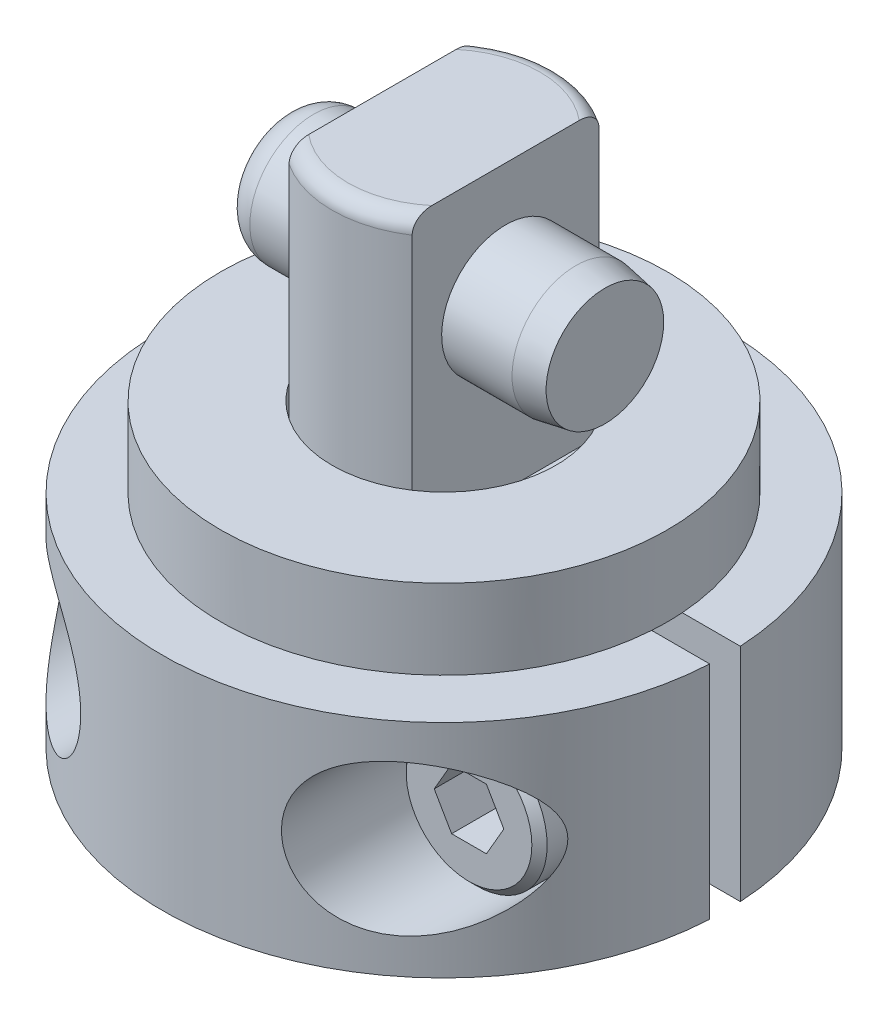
from build123d import *

# Parameters (mm, degrees)
FILLET1_R                  = 0.7874
CUT_EXTRUDE1_DEPTH         = 23.644751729
CUT_EXTRUDE1_DEPTH_BACK    = 23.644751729
SKETCH2_W                  = 2.5019
SKETCH2_H                  = 14.0716
CUT_EXTRUDE2_START         = 2.54
SKETCH3_R                  = 2.9972
SKETCH3_R_2                = 2.413
CUT_EXTRUDE2_DEPTH         = 2.54
CHAMFER1_SIZE              = 0.762
SKETCH4_R                  = 3.17754
EXTRUDE1_DEPTH             = 8.001
CHAMFER2_SIZE              = 0.254
CHAMFER2_SIZE2             = 1.440505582
FILLET2_R                  = 1.524
EXTRUDE2_DEPTH             = 5.4991
EXTRUDE2_DEPTH_BACK        = 5.4991
CUT_EXTRUDE3_START         = 2.7432
SKETCH6_R                  = 3.7465
CUT_EXTRUDE3_DEPTH         = 27.650186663
SKETCH7_R                  = 3.5052
EXTRUDE3_DEPTH             = 3.9878
CHAMFER3_SIZE              = 0.381
CUT_EXTRUDE4_DEPTH         = 2.9972
EXTRUDE4_REACH             = 31.018
SKETCH10_R                 = 1.9939
EXTRUDE4_DIRECTION_2_REACH = 31.018
SKETCH11_R                 = 11.1125
SKETCH11_R_2               = 5.5626
EXTRUDE5_DEPTH             = 3.9624


with BuildPart() as part:
    # Sketch1 → Revolve1 (revolve)
    with BuildSketch(Plane(origin=(0, 0, 0), x_dir=(0, 0, -1), z_dir=(1, 0, 0))):
        Polygon((0, 21.2344), (5.5626, 21.2344), (5.5626, 0.6096), (2.9972, 0.6096), (2.9972, -5.7404), (0, -5.7404), align=None)
    revolve(axis=Axis((0, -15.35938, 0), (0, 1, 0)))

    # Fillet1
    fillet1_edges = [part.edges().sort_by_distance(p)[0] for p in [
        (0, 21.2344, 5.5626),
    ]]
    fillet(fillet1_edges, radius=FILLET1_R)

    # Sketch2 → Cut-Extrude1 (cut, two sides: drawn at the far end of the back side and taken through both)
    with BuildSketch(Plane.XY.offset(-CUT_EXTRUDE1_DEPTH_BACK)):
        with Locations((4.31165, 14.1986)):
            Rectangle(SKETCH2_W, SKETCH2_H)
        with Locations((-4.31165, 14.1986)):
            Rectangle(SKETCH2_W, SKETCH2_H)
    extrude(amount=CUT_EXTRUDE1_DEPTH + CUT_EXTRUDE1_DEPTH_BACK, mode=Mode.SUBTRACT)

    # Sketch3 → Cut-Extrude2 (cut)
    with BuildSketch(Plane.XZ.offset(-0.6096).offset(CUT_EXTRUDE2_START)):
        with Locations(Location((0, 0, 0), (0, 0, 270))):
            Circle(SKETCH3_R)
        with Locations(Location((0, 0, 0), (0, 0, 270))):
            Circle(SKETCH3_R_2, mode=Mode.SUBTRACT)
    extrude(amount=-CUT_EXTRUDE2_DEPTH, mode=Mode.SUBTRACT)

    # Chamfer1
    chamfer1_edges = [part.edges().sort_by_distance(p)[0] for p in [
        (0, -5.7404, 2.9972),
    ]]
    chamfer(chamfer1_edges, length=CHAMFER1_SIZE)

    # Sketch4 → Extrude1 (add, symmetric)
    with BuildSketch(Plane(origin=(0, 0, 0), x_dir=(0, 0, -1), z_dir=(1, 0, 0))):
        with Locations(Location((0, 15.3924, 0), (0, 0, 90))):
            Circle(SKETCH4_R)
    extrude(amount=EXTRUDE1_DEPTH, both=True)

    # Chamfer2
    chamfer2_edges = [part.edges().sort_by_distance(p)[0] for p in [
        (8.001, 12.21486, 0),
    ]]
    chamfer2_side = [part.faces().sort_by_distance(p)[0] for p in [
        (8.001, 15.3924, 0),
    ]]
    chamfer(chamfer2_edges, length=CHAMFER2_SIZE, length2=CHAMFER2_SIZE2, reference=chamfer2_side[0])

    # Fillet2
    fillet2_edges = [part.edges().sort_by_distance(p)[0] for p in [
        (-8.001, 12.21486, 0),
    ]]
    fillet(fillet2_edges, radius=FILLET2_R)

    # Sketch5 → Extrude2 (add, two sides: drawn at the far end of the back side and taken through both)
    with BuildSketch(Plane(origin=(0, 0, 0), x_dir=(1, 0, 0), z_dir=(0, 1, 0)).offset(-EXTRUDE2_DEPTH_BACK)):
        with BuildLine():
            Line((5.510161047, 0.762), (13.974640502, 0.762))
            ThreePointArc((13.974640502, 0.762), (0, 13.9954), (-13.974640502, 0.762))
            Line((-13.974640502, 0.762), (-5.510161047, 0.762))
            ThreePointArc((-5.510161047, 0.762), (0, 5.5626), (5.510161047, 0.762))
        make_face()
        with BuildLine():
            Line((5.510161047, -0.762), (13.974640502, -0.762))
            ThreePointArc((13.974640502, -0.762), (0, -13.9954), (-13.974640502, -0.762))
            Line((-13.974640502, -0.762), (-5.510161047, -0.762))
            ThreePointArc((-5.510161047, -0.762), (0, -5.5626), (5.510161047, -0.762))
        make_face()
    extrude(amount=EXTRUDE2_DEPTH + EXTRUDE2_DEPTH_BACK)

    # Sketch6 → Cut-Extrude3 (cut, through all)
    with BuildSketch(Plane.XY.offset(0.762).offset(CUT_EXTRUDE3_START)):
        with Locations(Location((8.7376, 0, 0), (0, 0, 180))):
            Circle(SKETCH6_R)
        with Locations(Location((-8.7376, 0, 0), (0, 0, 180))):
            Circle(SKETCH6_R)
    extrude(amount=CUT_EXTRUDE3_DEPTH, mode=Mode.SUBTRACT)

    # Sketch7 → Extrude3 (add)
    with BuildSketch(Plane.XY.offset(3.5052)):
        with Locations((8.7376, 0)):
            Circle(SKETCH7_R)
        with Locations((-8.7376, 0)):
            Circle(SKETCH7_R)
    extrude(amount=EXTRUDE3_DEPTH)

    # Chamfer3
    chamfer3_edges = [part.edges().sort_by_distance(p)[0] for p in [
        (5.2324, 0, 7.493),
        (-12.2428, 0, 7.493),
    ]]
    chamfer(chamfer3_edges, length=CHAMFER3_SIZE)

    # Sketch8 → Cut-Extrude4 (cut)
    with BuildSketch(Plane.XY.offset(7.493)):
        Polygon((9.602817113, 1.4986), (10.468034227, 0), (9.602817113, -1.4986), (7.872382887, -1.4986), (7.007165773, 0), (7.872382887, 1.4986), align=None)
        Polygon((-10.468034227, 0), (-9.602817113, -1.4986), (-7.872382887, -1.4986), (-7.007165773, 0), (-7.872382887, 1.4986), (-9.602817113, 1.4986), align=None)
    extrude(amount=-CUT_EXTRUDE4_DEPTH, mode=Mode.SUBTRACT)

    # Sketch10 → Extrude4 (add, up to next)
    with BuildSketch(Plane.XY, mode=Mode.PRIVATE) as extrude4_sk1:
        with Locations((8.7376, 0)):
            Circle(SKETCH10_R)
    extrude4_tool1 = extrude(extrude4_sk1.sketch, amount=EXTRUDE4_REACH, mode=Mode.PRIVATE) - part.part
    # Sketch10 → Extrude4 (add, up to next)
    with BuildSketch(Plane.XY, mode=Mode.PRIVATE) as extrude4_sk2:
        with Locations((-8.7376, 0)):
            Circle(SKETCH10_R)
    extrude4_tool2 = extrude(extrude4_sk2.sketch, amount=EXTRUDE4_REACH, mode=Mode.PRIVATE) - part.part
    add(extrude4_tool1.solids().sort_by_distance((8.7376, 0, 0))[0])
    add(extrude4_tool2.solids().sort_by_distance((-8.7376, 0, 0))[0])

    # Sketch10 → Extrude4 direction 2 (add, up to next)
    with BuildSketch(Plane.XY, mode=Mode.PRIVATE) as extrude4_direction_2_sk1:
        with Locations((8.7376, 0)):
            Circle(SKETCH10_R)
    extrude4_direction_2_tool1 = extrude(extrude4_direction_2_sk1.sketch, amount=-EXTRUDE4_DIRECTION_2_REACH, mode=Mode.PRIVATE) - part.part
    # Sketch10 → Extrude4 direction 2 (add, up to next)
    with BuildSketch(Plane.XY, mode=Mode.PRIVATE) as extrude4_direction_2_sk2:
        with Locations((-8.7376, 0)):
            Circle(SKETCH10_R)
    extrude4_direction_2_tool2 = extrude(extrude4_direction_2_sk2.sketch, amount=-EXTRUDE4_DIRECTION_2_REACH, mode=Mode.PRIVATE) - part.part
    add(extrude4_direction_2_tool1.solids().sort_by_distance((8.7376, 0, 0))[0])
    add(extrude4_direction_2_tool2.solids().sort_by_distance((-8.7376, 0, 0))[0])

    # Sketch11 → Extrude5 (add)
    with BuildSketch(Plane(origin=(0, 5.4991, 0), x_dir=(-1, 0, 0), z_dir=(0, 1, 0))):
        with Locations(Location((0, 0, 0), (0, 0, 183.931938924))):
            Circle(SKETCH11_R)
        Circle(SKETCH11_R_2, mode=Mode.SUBTRACT)
    extrude(amount=EXTRUDE5_DEPTH)


solid = part.part
